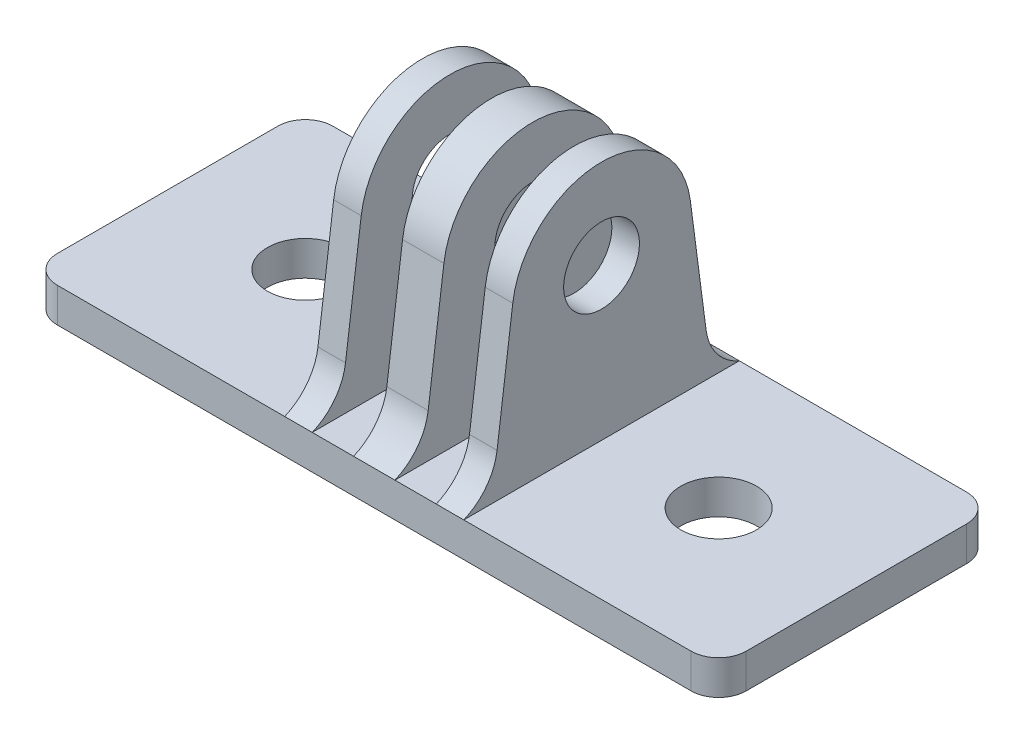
ISO-10303-21;
HEADER;
FILE_DESCRIPTION(('STEP AP214'),'2;1');
FILE_NAME('part.step','',(''),(''),'','','');
FILE_SCHEMA(('AUTOMOTIVE_DESIGN { 1 0 10303 214 1 1 1 1 }'));
ENDSEC;
DATA;
#1=APPLICATION_CONTEXT('core data for automotive mechanical design processes');
#2=APPLICATION_PROTOCOL_DEFINITION('international standard','automotive_design',2000,#1);
#3=PRODUCT_CONTEXT('',#1,'mechanical');
#4=PRODUCT('Part','Part','',(#3));
#5=PRODUCT_RELATED_PRODUCT_CATEGORY('part','',(#4));
#6=PRODUCT_DEFINITION_FORMATION('','',#4);
#7=PRODUCT_DEFINITION_CONTEXT('part definition',#1,'design');
#8=PRODUCT_DEFINITION('design','',#6,#7);
#9=PRODUCT_DEFINITION_SHAPE('','',#8);
#10=(LENGTH_UNIT() NAMED_UNIT(*) SI_UNIT(.MILLI.,.METRE.));
#11=(NAMED_UNIT(*) PLANE_ANGLE_UNIT() SI_UNIT($,.RADIAN.));
#12=(NAMED_UNIT(*) SI_UNIT($,.STERADIAN.) SOLID_ANGLE_UNIT());
#13=UNCERTAINTY_MEASURE_WITH_UNIT(LENGTH_MEASURE(1.E-05),#10,'distance_accuracy_value','');
#14=(GEOMETRIC_REPRESENTATION_CONTEXT(3) GLOBAL_UNCERTAINTY_ASSIGNED_CONTEXT((#13)) GLOBAL_UNIT_ASSIGNED_CONTEXT((#10,
#11,#12)) REPRESENTATION_CONTEXT('',''));
#15=CARTESIAN_POINT('',(0.,0.,0.));
#16=DIRECTION('',(0.,0.,1.));
#17=DIRECTION('',(1.,0.,0.));
#18=AXIS2_PLACEMENT_3D('',#15,#16,#17);
#19=CARTESIAN_POINT('',(50.,-11.,-8.));
#20=DIRECTION('',(0.,-0.130175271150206,0.991490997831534));
#21=DIRECTION('',(0.,-0.991490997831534,-0.130175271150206));
#22=AXIS2_PLACEMENT_3D('',#19,#20,#21);
#23=PLANE('',#22);
#24=DIRECTION('',(-1.,0.,0.));
#25=VECTOR('',#24,1.);
#26=CARTESIAN_POINT('',(50.,0.846139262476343,-6.44469148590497));
#27=LINE('',#26,#25);
#28=CARTESIAN_POINT('',(26.5,0.846139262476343,-6.44469148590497));
#29=VERTEX_POINT('',#28);
#30=CARTESIAN_POINT('',(23.5,0.846139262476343,-6.44469148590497));
#31=VERTEX_POINT('',#30);
#32=EDGE_CURVE('E489',#29,#31,#27,.T.);
#33=ORIENTED_EDGE('',*,*,#32,.F.);
#34=DIRECTION('',(0.,-0.991490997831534,-0.130175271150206));
#35=VECTOR('',#34,1.);
#36=CARTESIAN_POINT('',(26.5,-11.,-8.));
#37=LINE('',#36,#35);
#38=CARTESIAN_POINT('',(26.5,-7.83330681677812,-7.58423712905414));
#39=VERTEX_POINT('',#38);
#40=EDGE_CURVE('E397',#29,#39,#37,.T.);
#41=ORIENTED_EDGE('',*,*,#40,.T.);
#42=DIRECTION('',(-1.,0.,0.));
#43=VECTOR('',#42,1.);
#44=CARTESIAN_POINT('',(50.,-7.83330681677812,-7.58423712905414));
#45=LINE('',#44,#43);
#46=CARTESIAN_POINT('',(23.5,-7.83330681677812,-7.58423712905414));
#47=VERTEX_POINT('',#46);
#48=EDGE_CURVE('E458',#39,#47,#45,.T.);
#49=ORIENTED_EDGE('',*,*,#48,.T.);
#50=DIRECTION('',(0.,0.991490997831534,0.130175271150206));
#51=VECTOR('',#50,1.);
#52=CARTESIAN_POINT('',(23.5,-11.,-8.));
#53=LINE('',#52,#51);
#54=EDGE_CURVE('E418',#47,#31,#53,.T.);
#55=ORIENTED_EDGE('',*,*,#54,.T.);
#56=EDGE_LOOP('',(#33,#41,#49,#55));
#57=FACE_BOUND('',#56,.T.);
#58=ADVANCED_FACE('F31',(#57),#23,.F.);
#59=CARTESIAN_POINT('',(50.,0.,0.));
#60=DIRECTION('',(-1.,0.,0.));
#61=DIRECTION('',(0.,0.,1.));
#62=AXIS2_PLACEMENT_3D('',#59,#60,#61);
#63=CYLINDRICAL_SURFACE('',#62,6.5);
#64=DIRECTION('',(-1.,0.,0.));
#65=VECTOR('',#64,1.);
#66=CARTESIAN_POINT('',(50.,0.846139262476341,6.44469148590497));
#67=LINE('',#66,#65);
#68=CARTESIAN_POINT('',(26.5,0.846139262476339,6.44469148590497));
#69=VERTEX_POINT('',#68);
#70=CARTESIAN_POINT('',(23.5,0.846139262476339,6.44469148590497));
#71=VERTEX_POINT('',#70);
#72=EDGE_CURVE('E259',#69,#71,#67,.T.);
#73=ORIENTED_EDGE('',*,*,#72,.F.);
#74=CARTESIAN_POINT('',(26.5,0.,0.));
#75=DIRECTION('',(-1.,0.,0.));
#76=DIRECTION('',(0.,0.,1.));
#77=AXIS2_PLACEMENT_3D('',#74,#75,#76);
#78=CIRCLE('',#77,6.5);
#79=EDGE_CURVE('E394',#69,#29,#78,.T.);
#80=ORIENTED_EDGE('',*,*,#79,.T.);
#81=ORIENTED_EDGE('',*,*,#32,.T.);
#82=CARTESIAN_POINT('',(23.5,0.,0.));
#83=DIRECTION('',(1.,0.,0.));
#84=DIRECTION('',(0.,0.,-1.));
#85=AXIS2_PLACEMENT_3D('',#82,#83,#84);
#86=CIRCLE('',#85,6.5);
#87=EDGE_CURVE('E415',#31,#71,#86,.T.);
#88=ORIENTED_EDGE('',*,*,#87,.T.);
#89=EDGE_LOOP('',(#73,#80,#81,#88));
#90=FACE_BOUND('',#89,.T.);
#91=ADVANCED_FACE('F509',(#90),#63,.T.);
#92=CARTESIAN_POINT('',(50.,-11.,8.));
#93=DIRECTION('',(0.,-0.130175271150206,-0.991490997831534));
#94=DIRECTION('',(0.,0.991490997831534,-0.130175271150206));
#95=AXIS2_PLACEMENT_3D('',#92,#93,#94);
#96=PLANE('',#95);
#97=DIRECTION('',(1.,0.,0.));
#98=VECTOR('',#97,1.);
#99=CARTESIAN_POINT('',(50.,-7.83330681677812,7.58423712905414));
#100=LINE('',#99,#98);
#101=CARTESIAN_POINT('',(23.5,-7.83330681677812,7.58423712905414));
#102=VERTEX_POINT('',#101);
#103=CARTESIAN_POINT('',(26.5,-7.83330681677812,7.58423712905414));
#104=VERTEX_POINT('',#103);
#105=EDGE_CURVE('E465',#102,#104,#100,.T.);
#106=ORIENTED_EDGE('',*,*,#105,.T.);
#107=DIRECTION('',(0.,0.991490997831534,-0.130175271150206));
#108=VECTOR('',#107,1.);
#109=CARTESIAN_POINT('',(26.5,-11.,8.));
#110=LINE('',#109,#108);
#111=EDGE_CURVE('E391',#104,#69,#110,.T.);
#112=ORIENTED_EDGE('',*,*,#111,.T.);
#113=ORIENTED_EDGE('',*,*,#72,.T.);
#114=DIRECTION('',(0.,-0.991490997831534,0.130175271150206));
#115=VECTOR('',#114,1.);
#116=CARTESIAN_POINT('',(23.5,-11.,8.));
#117=LINE('',#116,#115);
#118=EDGE_CURVE('E411',#71,#102,#117,.T.);
#119=ORIENTED_EDGE('',*,*,#118,.T.);
#120=EDGE_LOOP('',(#106,#112,#113,#119));
#121=FACE_BOUND('',#120,.T.);
#122=ADVANCED_FACE('F482',(#121),#96,.F.);
#123=CARTESIAN_POINT('',(50.,-7.31260573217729,-11.5502011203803));
#124=DIRECTION('',(-1.,0.,0.));
#125=DIRECTION('',(0.,0.,1.));
#126=AXIS2_PLACEMENT_3D('',#123,#124,#125);
#127=CYLINDRICAL_SURFACE('',#126,4.);
#128=ORIENTED_EDGE('',*,*,#48,.F.);
#129=CARTESIAN_POINT('',(26.5,-7.31260573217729,-11.5502011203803));
#130=DIRECTION('',(-1.,0.,0.));
#131=DIRECTION('',(0.,0.,1.));
#132=AXIS2_PLACEMENT_3D('',#129,#130,#131);
#133=CIRCLE('',#132,4.);
#134=CARTESIAN_POINT('',(26.5,-11.,-10.));
#135=VERTEX_POINT('',#134);
#136=EDGE_CURVE('E400',#39,#135,#133,.F.);
#137=ORIENTED_EDGE('',*,*,#136,.T.);
#138=DIRECTION('',(-1.,0.,0.));
#139=VECTOR('',#138,1.);
#140=CARTESIAN_POINT('',(50.,-11.,-10.));
#141=LINE('',#140,#139);
#142=CARTESIAN_POINT('',(23.5,-11.,-10.));
#143=VERTEX_POINT('',#142);
#144=EDGE_CURVE('E492',#135,#143,#141,.T.);
#145=ORIENTED_EDGE('',*,*,#144,.T.);
#146=CARTESIAN_POINT('',(23.5,-7.31260573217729,-11.5502011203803));
#147=DIRECTION('',(1.,0.,0.));
#148=DIRECTION('',(0.,0.,-1.));
#149=AXIS2_PLACEMENT_3D('',#146,#147,#148);
#150=CIRCLE('',#149,4.);
#151=EDGE_CURVE('E421',#143,#47,#150,.F.);
#152=ORIENTED_EDGE('',*,*,#151,.T.);
#153=EDGE_LOOP('',(#128,#137,#145,#152));
#154=FACE_BOUND('',#153,.T.);
#155=ADVANCED_FACE('F496',(#154),#127,.F.);
#156=CARTESIAN_POINT('',(50.,-7.31260573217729,11.5502011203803));
#157=DIRECTION('',(1.,0.,0.));
#158=DIRECTION('',(0.,0.,-1.));
#159=AXIS2_PLACEMENT_3D('',#156,#157,#158);
#160=CYLINDRICAL_SURFACE('',#159,4.);
#161=DIRECTION('',(-1.,0.,0.));
#162=VECTOR('',#161,1.);
#163=CARTESIAN_POINT('',(50.,-11.,10.));
#164=LINE('',#163,#162);
#165=CARTESIAN_POINT('',(26.5,-11.,10.));
#166=VERTEX_POINT('',#165);
#167=CARTESIAN_POINT('',(23.5,-11.,10.));
#168=VERTEX_POINT('',#167);
#169=EDGE_CURVE('E246',#166,#168,#164,.T.);
#170=ORIENTED_EDGE('',*,*,#169,.F.);
#171=CARTESIAN_POINT('',(26.5,-7.31260573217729,11.5502011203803));
#172=DIRECTION('',(-1.,0.,0.));
#173=DIRECTION('',(0.,0.,1.));
#174=AXIS2_PLACEMENT_3D('',#171,#172,#173);
#175=CIRCLE('',#174,4.);
#176=EDGE_CURVE('E295',#166,#104,#175,.F.);
#177=ORIENTED_EDGE('',*,*,#176,.T.);
#178=ORIENTED_EDGE('',*,*,#105,.F.);
#179=CARTESIAN_POINT('',(23.5,-7.31260573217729,11.5502011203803));
#180=DIRECTION('',(1.,0.,0.));
#181=DIRECTION('',(0.,0.,-1.));
#182=AXIS2_PLACEMENT_3D('',#179,#180,#181);
#183=CIRCLE('',#182,4.);
#184=EDGE_CURVE('E300',#102,#168,#183,.F.);
#185=ORIENTED_EDGE('',*,*,#184,.T.);
#186=EDGE_LOOP('',(#170,#177,#178,#185));
#187=FACE_BOUND('',#186,.T.);
#188=ADVANCED_FACE('F474',(#187),#160,.F.);
#189=CARTESIAN_POINT('',(20.5,-7.83330681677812,-7.58423712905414));
#190=VERTEX_POINT('',#189);
#191=CARTESIAN_POINT('',(18.5,-7.83330681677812,-7.58423712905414));
#192=VERTEX_POINT('',#191);
#193=EDGE_CURVE('E455',#190,#192,#45,.T.);
#194=ORIENTED_EDGE('',*,*,#193,.T.);
#195=DIRECTION('',(0.,0.991490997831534,0.130175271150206));
#196=VECTOR('',#195,1.);
#197=CARTESIAN_POINT('',(18.5,-11.,-8.));
#198=LINE('',#197,#196);
#199=CARTESIAN_POINT('',(18.5,0.846139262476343,-6.44469148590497));
#200=VERTEX_POINT('',#199);
#201=EDGE_CURVE('E446',#192,#200,#198,.T.);
#202=ORIENTED_EDGE('',*,*,#201,.T.);
#203=CARTESIAN_POINT('',(20.5,0.846139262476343,-6.44469148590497));
#204=VERTEX_POINT('',#203);
#205=EDGE_CURVE('E485',#204,#200,#27,.T.);
#206=ORIENTED_EDGE('',*,*,#205,.F.);
#207=DIRECTION('',(0.,-0.991490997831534,-0.130175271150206));
#208=VECTOR('',#207,1.);
#209=CARTESIAN_POINT('',(20.5,-11.,-8.));
#210=LINE('',#209,#208);
#211=EDGE_CURVE('E430',#204,#190,#210,.T.);
#212=ORIENTED_EDGE('',*,*,#211,.T.);
#213=EDGE_LOOP('',(#194,#202,#206,#212));
#214=FACE_BOUND('',#213,.T.);
#215=ADVANCED_FACE('F457',(#214),#23,.F.);
#216=ORIENTED_EDGE('',*,*,#205,.T.);
#217=CARTESIAN_POINT('',(18.5,0.,0.));
#218=DIRECTION('',(1.,0.,0.));
#219=DIRECTION('',(0.,0.,-1.));
#220=AXIS2_PLACEMENT_3D('',#217,#218,#219);
#221=CIRCLE('',#220,6.5);
#222=CARTESIAN_POINT('',(18.5,0.846139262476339,6.44469148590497));
#223=VERTEX_POINT('',#222);
#224=EDGE_CURVE('E444',#200,#223,#221,.T.);
#225=ORIENTED_EDGE('',*,*,#224,.T.);
#226=CARTESIAN_POINT('',(20.5,0.846139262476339,6.44469148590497));
#227=VERTEX_POINT('',#226);
#228=EDGE_CURVE('E255',#227,#223,#67,.T.);
#229=ORIENTED_EDGE('',*,*,#228,.F.);
#230=CARTESIAN_POINT('',(20.5,0.,0.));
#231=DIRECTION('',(-1.,0.,0.));
#232=DIRECTION('',(0.,0.,1.));
#233=AXIS2_PLACEMENT_3D('',#230,#231,#232);
#234=CIRCLE('',#233,6.5);
#235=EDGE_CURVE('E427',#227,#204,#234,.T.);
#236=ORIENTED_EDGE('',*,*,#235,.T.);
#237=EDGE_LOOP('',(#216,#225,#229,#236));
#238=FACE_BOUND('',#237,.T.);
#239=ADVANCED_FACE('F507',(#238),#63,.T.);
#240=ORIENTED_EDGE('',*,*,#228,.T.);
#241=DIRECTION('',(0.,-0.991490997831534,0.130175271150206));
#242=VECTOR('',#241,1.);
#243=CARTESIAN_POINT('',(18.5,-11.,8.));
#244=LINE('',#243,#242);
#245=CARTESIAN_POINT('',(18.5,-7.83330681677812,7.58423712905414));
#246=VERTEX_POINT('',#245);
#247=EDGE_CURVE('E229',#223,#246,#244,.T.);
#248=ORIENTED_EDGE('',*,*,#247,.T.);
#249=CARTESIAN_POINT('',(20.5,-7.83330681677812,7.58423712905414));
#250=VERTEX_POINT('',#249);
#251=EDGE_CURVE('E239',#246,#250,#100,.T.);
#252=ORIENTED_EDGE('',*,*,#251,.T.);
#253=DIRECTION('',(0.,0.991490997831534,-0.130175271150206));
#254=VECTOR('',#253,1.);
#255=CARTESIAN_POINT('',(20.5,-11.,8.));
#256=LINE('',#255,#254);
#257=EDGE_CURVE('E424',#250,#227,#256,.T.);
#258=ORIENTED_EDGE('',*,*,#257,.T.);
#259=EDGE_LOOP('',(#240,#248,#252,#258));
#260=FACE_BOUND('',#259,.T.);
#261=ADVANCED_FACE('F505',(#260),#96,.F.);
#262=CARTESIAN_POINT('',(20.5,-11.,-10.));
#263=VERTEX_POINT('',#262);
#264=CARTESIAN_POINT('',(18.5,-11.,-10.));
#265=VERTEX_POINT('',#264);
#266=EDGE_CURVE('E456',#263,#265,#141,.T.);
#267=ORIENTED_EDGE('',*,*,#266,.T.);
#268=CARTESIAN_POINT('',(18.5,-7.31260573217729,-11.5502011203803));
#269=DIRECTION('',(1.,0.,0.));
#270=DIRECTION('',(0.,0.,-1.));
#271=AXIS2_PLACEMENT_3D('',#268,#269,#270);
#272=CIRCLE('',#271,4.);
#273=EDGE_CURVE('E228',#265,#192,#272,.F.);
#274=ORIENTED_EDGE('',*,*,#273,.T.);
#275=ORIENTED_EDGE('',*,*,#193,.F.);
#276=CARTESIAN_POINT('',(20.5,-7.31260573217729,-11.5502011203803));
#277=DIRECTION('',(-1.,0.,0.));
#278=DIRECTION('',(0.,0.,1.));
#279=AXIS2_PLACEMENT_3D('',#276,#277,#278);
#280=CIRCLE('',#279,4.);
#281=EDGE_CURVE('E433',#190,#263,#280,.F.);
#282=ORIENTED_EDGE('',*,*,#281,.T.);
#283=EDGE_LOOP('',(#267,#274,#275,#282));
#284=FACE_BOUND('',#283,.T.);
#285=ADVANCED_FACE('F454',(#284),#127,.F.);
#286=ORIENTED_EDGE('',*,*,#251,.F.);
#287=CARTESIAN_POINT('',(18.5,-7.31260573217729,11.5502011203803));
#288=DIRECTION('',(1.,0.,0.));
#289=DIRECTION('',(0.,0.,-1.));
#290=AXIS2_PLACEMENT_3D('',#287,#288,#289);
#291=CIRCLE('',#290,4.);
#292=CARTESIAN_POINT('',(18.5,-11.,10.));
#293=VERTEX_POINT('',#292);
#294=EDGE_CURVE('E225',#246,#293,#291,.F.);
#295=ORIENTED_EDGE('',*,*,#294,.T.);
#296=CARTESIAN_POINT('',(20.5,-11.,10.));
#297=VERTEX_POINT('',#296);
#298=EDGE_CURVE('E237',#297,#293,#164,.T.);
#299=ORIENTED_EDGE('',*,*,#298,.F.);
#300=CARTESIAN_POINT('',(20.5,-7.31260573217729,11.5502011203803));
#301=DIRECTION('',(-1.,0.,0.));
#302=DIRECTION('',(0.,0.,1.));
#303=AXIS2_PLACEMENT_3D('',#300,#301,#302);
#304=CIRCLE('',#303,4.);
#305=EDGE_CURVE('E296',#297,#250,#304,.F.);
#306=ORIENTED_EDGE('',*,*,#305,.T.);
#307=EDGE_LOOP('',(#286,#295,#299,#306));
#308=FACE_BOUND('',#307,.T.);
#309=ADVANCED_FACE('F235',(#308),#160,.F.);
#310=CARTESIAN_POINT('',(50.,-11.,10.));
#311=DIRECTION('',(0.,0.,-1.));
#312=DIRECTION('',(-1.,0.,0.));
#313=AXIS2_PLACEMENT_3D('',#310,#311,#312);
#314=PLANE('',#313);
#315=DIRECTION('',(-1.,0.,0.));
#316=VECTOR('',#315,1.);
#317=CARTESIAN_POINT('',(50.,-13.5,10.));
#318=LINE('',#317,#316);
#319=CARTESIAN_POINT('',(48.,-13.5,10.));
#320=VERTEX_POINT('',#319);
#321=CARTESIAN_POINT('',(2.,-13.5,10.));
#322=VERTEX_POINT('',#321);
#323=EDGE_CURVE('E351',#320,#322,#318,.T.);
#324=ORIENTED_EDGE('',*,*,#323,.F.);
#325=DIRECTION('',(0.,-1.,0.));
#326=VECTOR('',#325,1.);
#327=CARTESIAN_POINT('',(48.,-11.,10.));
#328=LINE('',#327,#326);
#329=CARTESIAN_POINT('',(48.,-11.,10.));
#330=VERTEX_POINT('',#329);
#331=EDGE_CURVE('E325',#320,#330,#328,.F.);
#332=ORIENTED_EDGE('',*,*,#331,.T.);
#333=CARTESIAN_POINT('',(31.5,-11.,10.));
#334=VERTEX_POINT('',#333);
#335=EDGE_CURVE('E249',#330,#334,#164,.T.);
#336=ORIENTED_EDGE('',*,*,#335,.T.);
#337=CARTESIAN_POINT('',(29.5,-11.,10.));
#338=VERTEX_POINT('',#337);
#339=EDGE_CURVE('E250',#334,#338,#164,.T.);
#340=ORIENTED_EDGE('',*,*,#339,.T.);
#341=DIRECTION('',(1.,0.,0.));
#342=VECTOR('',#341,1.);
#343=CARTESIAN_POINT('',(26.5,-11.,10.));
#344=LINE('',#343,#342);
#345=EDGE_CURVE('E265',#166,#338,#344,.T.);
#346=ORIENTED_EDGE('',*,*,#345,.F.);
#347=ORIENTED_EDGE('',*,*,#169,.T.);
#348=DIRECTION('',(1.,0.,0.));
#349=VECTOR('',#348,1.);
#350=CARTESIAN_POINT('',(20.5,-11.,10.));
#351=LINE('',#350,#349);
#352=EDGE_CURVE('E245',#297,#168,#351,.T.);
#353=ORIENTED_EDGE('',*,*,#352,.F.);
#354=ORIENTED_EDGE('',*,*,#298,.T.);
#355=DIRECTION('',(1.,0.,0.));
#356=VECTOR('',#355,1.);
#357=CARTESIAN_POINT('',(0.,-11.,10.));
#358=LINE('',#357,#356);
#359=CARTESIAN_POINT('',(2.,-11.,10.));
#360=VERTEX_POINT('',#359);
#361=EDGE_CURVE('E206',#360,#293,#358,.T.);
#362=ORIENTED_EDGE('',*,*,#361,.F.);
#363=DIRECTION('',(0.,-1.,0.));
#364=VECTOR('',#363,1.);
#365=CARTESIAN_POINT('',(2.,-11.,10.));
#366=LINE('',#365,#364);
#367=EDGE_CURVE('E323',#360,#322,#366,.T.);
#368=ORIENTED_EDGE('',*,*,#367,.T.);
#369=EDGE_LOOP('',(#324,#332,#336,#340,#346,#347,#353,#354,#362,#368));
#370=FACE_BOUND('',#369,.T.);
#371=ADVANCED_FACE('F33',(#370),#314,.F.);
#372=CARTESIAN_POINT('',(50.,-13.5,10.));
#373=DIRECTION('',(0.,1.,0.));
#374=DIRECTION('',(0.,0.,1.));
#375=AXIS2_PLACEMENT_3D('',#372,#373,#374);
#376=PLANE('',#375);
#377=CARTESIAN_POINT('',(10.,-13.5,0.));
#378=DIRECTION('',(0.,1.,0.));
#379=DIRECTION('',(0.,0.,1.));
#380=AXIS2_PLACEMENT_3D('',#377,#378,#379);
#381=CIRCLE('',#380,2.75);
#382=CARTESIAN_POINT('',(10.,-13.5,2.75));
#383=VERTEX_POINT('',#382);
#384=EDGE_CURVE('E557',#383,#383,#381,.T.);
#385=ORIENTED_EDGE('',*,*,#384,.T.);
#386=EDGE_LOOP('',(#385));
#387=FACE_BOUND('',#386,.T.);
#388=CARTESIAN_POINT('',(40.,-13.5,0.));
#389=DIRECTION('',(0.,1.,0.));
#390=DIRECTION('',(0.,0.,1.));
#391=AXIS2_PLACEMENT_3D('',#388,#389,#390);
#392=CIRCLE('',#391,2.75);
#393=CARTESIAN_POINT('',(40.,-13.5,2.75));
#394=VERTEX_POINT('',#393);
#395=EDGE_CURVE('E560',#394,#394,#392,.T.);
#396=ORIENTED_EDGE('',*,*,#395,.T.);
#397=EDGE_LOOP('',(#396));
#398=FACE_BOUND('',#397,.T.);
#399=DIRECTION('',(0.,0.,-1.));
#400=VECTOR('',#399,1.);
#401=CARTESIAN_POINT('',(50.,-13.5,10.));
#402=LINE('',#401,#400);
#403=CARTESIAN_POINT('',(50.,-13.5,8.));
#404=VERTEX_POINT('',#403);
#405=CARTESIAN_POINT('',(50.,-13.5,-8.));
#406=VERTEX_POINT('',#405);
#407=EDGE_CURVE('E247',#404,#406,#402,.T.);
#408=ORIENTED_EDGE('',*,*,#407,.F.);
#409=CARTESIAN_POINT('',(48.,-13.5,8.));
#410=DIRECTION('',(0.,1.,0.));
#411=DIRECTION('',(0.,0.,1.));
#412=AXIS2_PLACEMENT_3D('',#409,#410,#411);
#413=CIRCLE('',#412,2.);
#414=EDGE_CURVE('E321',#404,#320,#413,.F.);
#415=ORIENTED_EDGE('',*,*,#414,.T.);
#416=ORIENTED_EDGE('',*,*,#323,.T.);
#417=CARTESIAN_POINT('',(2.,-13.5,8.));
#418=DIRECTION('',(0.,1.,0.));
#419=DIRECTION('',(0.,0.,1.));
#420=AXIS2_PLACEMENT_3D('',#417,#418,#419);
#421=CIRCLE('',#420,2.);
#422=CARTESIAN_POINT('',(0.,-13.5,8.));
#423=VERTEX_POINT('',#422);
#424=EDGE_CURVE('E319',#322,#423,#421,.F.);
#425=ORIENTED_EDGE('',*,*,#424,.T.);
#426=DIRECTION('',(0.,0.,-1.));
#427=VECTOR('',#426,1.);
#428=CARTESIAN_POINT('',(0.,-13.5,10.));
#429=LINE('',#428,#427);
#430=CARTESIAN_POINT('',(0.,-13.5,-8.));
#431=VERTEX_POINT('',#430);
#432=EDGE_CURVE('E252',#423,#431,#429,.T.);
#433=ORIENTED_EDGE('',*,*,#432,.T.);
#434=CARTESIAN_POINT('',(2.,-13.5,-8.));
#435=DIRECTION('',(0.,1.,0.));
#436=DIRECTION('',(0.,0.,1.));
#437=AXIS2_PLACEMENT_3D('',#434,#435,#436);
#438=CIRCLE('',#437,2.);
#439=CARTESIAN_POINT('',(2.,-13.5,-10.));
#440=VERTEX_POINT('',#439);
#441=EDGE_CURVE('E317',#431,#440,#438,.F.);
#442=ORIENTED_EDGE('',*,*,#441,.T.);
#443=DIRECTION('',(-1.,0.,0.));
#444=VECTOR('',#443,1.);
#445=CARTESIAN_POINT('',(50.,-13.5,-10.));
#446=LINE('',#445,#444);
#447=CARTESIAN_POINT('',(48.,-13.5,-10.));
#448=VERTEX_POINT('',#447);
#449=EDGE_CURVE('E341',#448,#440,#446,.T.);
#450=ORIENTED_EDGE('',*,*,#449,.F.);
#451=CARTESIAN_POINT('',(48.,-13.5,-8.));
#452=DIRECTION('',(0.,1.,0.));
#453=DIRECTION('',(0.,0.,1.));
#454=AXIS2_PLACEMENT_3D('',#451,#452,#453);
#455=CIRCLE('',#454,2.);
#456=EDGE_CURVE('E315',#448,#406,#455,.F.);
#457=ORIENTED_EDGE('',*,*,#456,.T.);
#458=EDGE_LOOP('',(#408,#415,#416,#425,#433,#442,#450,#457));
#459=FACE_BOUND('',#458,.T.);
#460=ADVANCED_FACE('F348',(#387,#398,#459),#376,.F.);
#461=CARTESIAN_POINT('',(50.,-11.,-10.));
#462=DIRECTION('',(0.,0.,1.));
#463=DIRECTION('',(1.,0.,0.));
#464=AXIS2_PLACEMENT_3D('',#461,#462,#463);
#465=PLANE('',#464);
#466=ORIENTED_EDGE('',*,*,#449,.T.);
#467=DIRECTION('',(0.,1.,0.));
#468=VECTOR('',#467,1.);
#469=CARTESIAN_POINT('',(2.,-11.,-10.));
#470=LINE('',#469,#468);
#471=CARTESIAN_POINT('',(2.,-11.,-10.));
#472=VERTEX_POINT('',#471);
#473=EDGE_CURVE('E11',#440,#472,#470,.T.);
#474=ORIENTED_EDGE('',*,*,#473,.T.);
#475=DIRECTION('',(1.,0.,0.));
#476=VECTOR('',#475,1.);
#477=CARTESIAN_POINT('',(0.,-11.,-10.));
#478=LINE('',#477,#476);
#479=EDGE_CURVE('E218',#472,#265,#478,.T.);
#480=ORIENTED_EDGE('',*,*,#479,.T.);
#481=ORIENTED_EDGE('',*,*,#266,.F.);
#482=DIRECTION('',(1.,0.,0.));
#483=VECTOR('',#482,1.);
#484=CARTESIAN_POINT('',(20.5,-11.,-10.));
#485=LINE('',#484,#483);
#486=EDGE_CURVE('E404',#263,#143,#485,.T.);
#487=ORIENTED_EDGE('',*,*,#486,.T.);
#488=ORIENTED_EDGE('',*,*,#144,.F.);
#489=DIRECTION('',(1.,0.,0.));
#490=VECTOR('',#489,1.);
#491=CARTESIAN_POINT('',(26.5,-11.,-10.));
#492=LINE('',#491,#490);
#493=CARTESIAN_POINT('',(29.5,-11.,-10.));
#494=VERTEX_POINT('',#493);
#495=EDGE_CURVE('E288',#135,#494,#492,.T.);
#496=ORIENTED_EDGE('',*,*,#495,.T.);
#497=CARTESIAN_POINT('',(31.5,-11.,-10.));
#498=VERTEX_POINT('',#497);
#499=EDGE_CURVE('E490',#498,#494,#141,.T.);
#500=ORIENTED_EDGE('',*,*,#499,.F.);
#501=CARTESIAN_POINT('',(48.,-11.,-10.));
#502=VERTEX_POINT('',#501);
#503=EDGE_CURVE('E343',#502,#498,#141,.T.);
#504=ORIENTED_EDGE('',*,*,#503,.F.);
#505=DIRECTION('',(0.,1.,0.));
#506=VECTOR('',#505,1.);
#507=CARTESIAN_POINT('',(48.,-13.5,-10.));
#508=LINE('',#507,#506);
#509=EDGE_CURVE('E39',#502,#448,#508,.F.);
#510=ORIENTED_EDGE('',*,*,#509,.T.);
#511=EDGE_LOOP('',(#466,#474,#480,#481,#487,#488,#496,#500,#504,#510));
#512=FACE_BOUND('',#511,.T.);
#513=ADVANCED_FACE('F340',(#512),#465,.F.);
#514=CARTESIAN_POINT('',(31.5,0.846139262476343,-6.44469148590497));
#515=VERTEX_POINT('',#514);
#516=CARTESIAN_POINT('',(29.5,0.846139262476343,-6.44469148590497));
#517=VERTEX_POINT('',#516);
#518=EDGE_CURVE('E487',#515,#517,#27,.T.);
#519=ORIENTED_EDGE('',*,*,#518,.F.);
#520=DIRECTION('',(0.,-0.991490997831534,-0.130175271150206));
#521=VECTOR('',#520,1.);
#522=CARTESIAN_POINT('',(31.5,-11.,-8.));
#523=LINE('',#522,#521);
#524=CARTESIAN_POINT('',(31.5,-7.83330681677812,-7.58423712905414));
#525=VERTEX_POINT('',#524);
#526=EDGE_CURVE('E376',#515,#525,#523,.T.);
#527=ORIENTED_EDGE('',*,*,#526,.T.);
#528=CARTESIAN_POINT('',(29.5,-7.83330681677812,-7.58423712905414));
#529=VERTEX_POINT('',#528);
#530=EDGE_CURVE('E460',#525,#529,#45,.T.);
#531=ORIENTED_EDGE('',*,*,#530,.T.);
#532=DIRECTION('',(0.,0.991490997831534,0.130175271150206));
#533=VECTOR('',#532,1.);
#534=CARTESIAN_POINT('',(29.5,-11.,-8.));
#535=LINE('',#534,#533);
#536=EDGE_CURVE('E387',#529,#517,#535,.T.);
#537=ORIENTED_EDGE('',*,*,#536,.T.);
#538=EDGE_LOOP('',(#519,#527,#531,#537));
#539=FACE_BOUND('',#538,.T.);
#540=ADVANCED_FACE('F519',(#539),#23,.F.);
#541=CARTESIAN_POINT('',(31.5,0.846139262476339,6.44469148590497));
#542=VERTEX_POINT('',#541);
#543=CARTESIAN_POINT('',(29.5,0.846139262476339,6.44469148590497));
#544=VERTEX_POINT('',#543);
#545=EDGE_CURVE('E260',#542,#544,#67,.T.);
#546=ORIENTED_EDGE('',*,*,#545,.F.);
#547=CARTESIAN_POINT('',(31.5,0.,0.));
#548=DIRECTION('',(-1.,0.,0.));
#549=DIRECTION('',(0.,0.,1.));
#550=AXIS2_PLACEMENT_3D('',#547,#548,#549);
#551=CIRCLE('',#550,6.5);
#552=EDGE_CURVE('E368',#542,#515,#551,.T.);
#553=ORIENTED_EDGE('',*,*,#552,.T.);
#554=ORIENTED_EDGE('',*,*,#518,.T.);
#555=CARTESIAN_POINT('',(29.5,0.,0.));
#556=DIRECTION('',(1.,0.,0.));
#557=DIRECTION('',(0.,0.,-1.));
#558=AXIS2_PLACEMENT_3D('',#555,#556,#557);
#559=CIRCLE('',#558,6.5);
#560=EDGE_CURVE('E384',#517,#544,#559,.T.);
#561=ORIENTED_EDGE('',*,*,#560,.T.);
#562=EDGE_LOOP('',(#546,#553,#554,#561));
#563=FACE_BOUND('',#562,.T.);
#564=ADVANCED_FACE('F523',(#563),#63,.T.);
#565=CARTESIAN_POINT('',(29.5,-7.83330681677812,7.58423712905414));
#566=VERTEX_POINT('',#565);
#567=CARTESIAN_POINT('',(31.5,-7.83330681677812,7.58423712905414));
#568=VERTEX_POINT('',#567);
#569=EDGE_CURVE('E294',#566,#568,#100,.T.);
#570=ORIENTED_EDGE('',*,*,#569,.T.);
#571=DIRECTION('',(0.,0.991490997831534,-0.130175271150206));
#572=VECTOR('',#571,1.);
#573=CARTESIAN_POINT('',(31.5,-11.,8.));
#574=LINE('',#573,#572);
#575=EDGE_CURVE('E364',#568,#542,#574,.T.);
#576=ORIENTED_EDGE('',*,*,#575,.T.);
#577=ORIENTED_EDGE('',*,*,#545,.T.);
#578=DIRECTION('',(0.,-0.991490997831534,0.130175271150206));
#579=VECTOR('',#578,1.);
#580=CARTESIAN_POINT('',(29.5,-11.,8.));
#581=LINE('',#580,#579);
#582=EDGE_CURVE('E283',#544,#566,#581,.T.);
#583=ORIENTED_EDGE('',*,*,#582,.T.);
#584=EDGE_LOOP('',(#570,#576,#577,#583));
#585=FACE_BOUND('',#584,.T.);
#586=ADVANCED_FACE('F524',(#585),#96,.F.);
#587=CARTESIAN_POINT('',(50.,0.,0.));
#588=DIRECTION('',(1.,0.,0.));
#589=DIRECTION('',(0.,0.,-1.));
#590=AXIS2_PLACEMENT_3D('',#587,#588,#589);
#591=PLANE('',#590);
#592=DIRECTION('',(0.,0.,1.));
#593=VECTOR('',#592,1.);
#594=CARTESIAN_POINT('',(50.,-11.,-10.));
#595=LINE('',#594,#593);
#596=CARTESIAN_POINT('',(50.,-11.,-8.));
#597=VERTEX_POINT('',#596);
#598=CARTESIAN_POINT('',(50.,-11.,8.));
#599=VERTEX_POINT('',#598);
#600=EDGE_CURVE('E359',#597,#599,#595,.T.);
#601=ORIENTED_EDGE('',*,*,#600,.T.);
#602=DIRECTION('',(0.,-1.,0.));
#603=VECTOR('',#602,1.);
#604=CARTESIAN_POINT('',(50.,-13.5,8.));
#605=LINE('',#604,#603);
#606=EDGE_CURVE('E312',#599,#404,#605,.T.);
#607=ORIENTED_EDGE('',*,*,#606,.T.);
#608=ORIENTED_EDGE('',*,*,#407,.T.);
#609=DIRECTION('',(0.,1.,0.));
#610=VECTOR('',#609,1.);
#611=CARTESIAN_POINT('',(50.,-11.,-8.));
#612=LINE('',#611,#610);
#613=EDGE_CURVE('E240',#406,#597,#612,.T.);
#614=ORIENTED_EDGE('',*,*,#613,.T.);
#615=EDGE_LOOP('',(#601,#607,#608,#614));
#616=FACE_BOUND('',#615,.T.);
#617=ADVANCED_FACE('F358',(#616),#591,.T.);
#618=CARTESIAN_POINT('',(0.,0.,0.));
#619=DIRECTION('',(1.,0.,0.));
#620=DIRECTION('',(0.,0.,-1.));
#621=AXIS2_PLACEMENT_3D('',#618,#619,#620);
#622=PLANE('',#621);
#623=ORIENTED_EDGE('',*,*,#432,.F.);
#624=DIRECTION('',(0.,-1.,0.));
#625=VECTOR('',#624,1.);
#626=CARTESIAN_POINT('',(0.,0.,8.));
#627=LINE('',#626,#625);
#628=CARTESIAN_POINT('',(0.,-11.,8.));
#629=VERTEX_POINT('',#628);
#630=EDGE_CURVE('E53',#423,#629,#627,.F.);
#631=ORIENTED_EDGE('',*,*,#630,.T.);
#632=DIRECTION('',(0.,0.,1.));
#633=VECTOR('',#632,1.);
#634=CARTESIAN_POINT('',(0.,-11.,-10.));
#635=LINE('',#634,#633);
#636=CARTESIAN_POINT('',(0.,-11.,-8.));
#637=VERTEX_POINT('',#636);
#638=EDGE_CURVE('E230',#637,#629,#635,.T.);
#639=ORIENTED_EDGE('',*,*,#638,.F.);
#640=DIRECTION('',(0.,1.,0.));
#641=VECTOR('',#640,1.);
#642=CARTESIAN_POINT('',(0.,0.,-8.));
#643=LINE('',#642,#641);
#644=EDGE_CURVE('E331',#637,#431,#643,.F.);
#645=ORIENTED_EDGE('',*,*,#644,.T.);
#646=EDGE_LOOP('',(#623,#631,#639,#645));
#647=FACE_BOUND('',#646,.T.);
#648=ADVANCED_FACE('F531',(#647),#622,.F.);
#649=ORIENTED_EDGE('',*,*,#530,.F.);
#650=CARTESIAN_POINT('',(31.5,-7.31260573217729,-11.5502011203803));
#651=DIRECTION('',(-1.,0.,0.));
#652=DIRECTION('',(0.,0.,1.));
#653=AXIS2_PLACEMENT_3D('',#650,#651,#652);
#654=CIRCLE('',#653,4.);
#655=EDGE_CURVE('E289',#525,#498,#654,.F.);
#656=ORIENTED_EDGE('',*,*,#655,.T.);
#657=ORIENTED_EDGE('',*,*,#499,.T.);
#658=CARTESIAN_POINT('',(29.5,-7.31260573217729,-11.5502011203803));
#659=DIRECTION('',(1.,0.,0.));
#660=DIRECTION('',(0.,0.,-1.));
#661=AXIS2_PLACEMENT_3D('',#658,#659,#660);
#662=CIRCLE('',#661,4.);
#663=EDGE_CURVE('E279',#494,#529,#662,.F.);
#664=ORIENTED_EDGE('',*,*,#663,.T.);
#665=EDGE_LOOP('',(#649,#656,#657,#664));
#666=FACE_BOUND('',#665,.T.);
#667=ADVANCED_FACE('F514',(#666),#127,.F.);
#668=ORIENTED_EDGE('',*,*,#339,.F.);
#669=CARTESIAN_POINT('',(31.5,-7.31260573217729,11.5502011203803));
#670=DIRECTION('',(-1.,0.,0.));
#671=DIRECTION('',(0.,0.,1.));
#672=AXIS2_PLACEMENT_3D('',#669,#670,#671);
#673=CIRCLE('',#672,4.);
#674=EDGE_CURVE('E241',#334,#568,#673,.F.);
#675=ORIENTED_EDGE('',*,*,#674,.T.);
#676=ORIENTED_EDGE('',*,*,#569,.F.);
#677=CARTESIAN_POINT('',(29.5,-7.31260573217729,11.5502011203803));
#678=DIRECTION('',(1.,0.,0.));
#679=DIRECTION('',(0.,0.,-1.));
#680=AXIS2_PLACEMENT_3D('',#677,#678,#679);
#681=CIRCLE('',#680,4.);
#682=EDGE_CURVE('E275',#566,#338,#681,.F.);
#683=ORIENTED_EDGE('',*,*,#682,.T.);
#684=EDGE_LOOP('',(#668,#675,#676,#683));
#685=FACE_BOUND('',#684,.T.);
#686=ADVANCED_FACE('F292',(#685),#160,.F.);
#687=CARTESIAN_POINT('',(20.5,-11.,-10.));
#688=DIRECTION('',(-1.,0.,0.));
#689=DIRECTION('',(0.,0.,1.));
#690=AXIS2_PLACEMENT_3D('',#687,#688,#689);
#691=PLANE('',#690);
#692=CARTESIAN_POINT('',(20.5,0.,0.));
#693=DIRECTION('',(-1.,0.,0.));
#694=DIRECTION('',(0.,0.,1.));
#695=AXIS2_PLACEMENT_3D('',#692,#693,#694);
#696=CIRCLE('',#695,2.75);
#697=CARTESIAN_POINT('',(20.5,0.,2.75));
#698=VERTEX_POINT('',#697);
#699=EDGE_CURVE('E219',#698,#698,#696,.T.);
#700=ORIENTED_EDGE('',*,*,#699,.T.);
#701=EDGE_LOOP('',(#700));
#702=FACE_BOUND('',#701,.T.);
#703=ORIENTED_EDGE('',*,*,#211,.F.);
#704=ORIENTED_EDGE('',*,*,#235,.F.);
#705=ORIENTED_EDGE('',*,*,#257,.F.);
#706=ORIENTED_EDGE('',*,*,#305,.F.);
#707=DIRECTION('',(0.,0.,1.));
#708=VECTOR('',#707,1.);
#709=CARTESIAN_POINT('',(20.5,-11.,-10.));
#710=LINE('',#709,#708);
#711=EDGE_CURVE('E407',#263,#297,#710,.T.);
#712=ORIENTED_EDGE('',*,*,#711,.F.);
#713=ORIENTED_EDGE('',*,*,#281,.F.);
#714=EDGE_LOOP('',(#703,#704,#705,#706,#712,#713));
#715=FACE_BOUND('',#714,.T.);
#716=ADVANCED_FACE('F503',(#702,#715),#691,.F.);
#717=CARTESIAN_POINT('',(23.5,-11.,-10.));
#718=DIRECTION('',(1.,0.,0.));
#719=DIRECTION('',(0.,0.,-1.));
#720=AXIS2_PLACEMENT_3D('',#717,#718,#719);
#721=PLANE('',#720);
#722=CARTESIAN_POINT('',(23.5,0.,0.));
#723=DIRECTION('',(1.,0.,0.));
#724=DIRECTION('',(0.,0.,-1.));
#725=AXIS2_PLACEMENT_3D('',#722,#723,#724);
#726=CIRCLE('',#725,2.75);
#727=CARTESIAN_POINT('',(23.5,0.,-2.75));
#728=VERTEX_POINT('',#727);
#729=EDGE_CURVE('E575',#728,#728,#726,.T.);
#730=ORIENTED_EDGE('',*,*,#729,.T.);
#731=EDGE_LOOP('',(#730));
#732=FACE_BOUND('',#731,.T.);
#733=DIRECTION('',(0.,0.,1.));
#734=VECTOR('',#733,1.);
#735=CARTESIAN_POINT('',(23.5,-11.,-10.));
#736=LINE('',#735,#734);
#737=EDGE_CURVE('E408',#143,#168,#736,.T.);
#738=ORIENTED_EDGE('',*,*,#737,.T.);
#739=ORIENTED_EDGE('',*,*,#184,.F.);
#740=ORIENTED_EDGE('',*,*,#118,.F.);
#741=ORIENTED_EDGE('',*,*,#87,.F.);
#742=ORIENTED_EDGE('',*,*,#54,.F.);
#743=ORIENTED_EDGE('',*,*,#151,.F.);
#744=EDGE_LOOP('',(#738,#739,#740,#741,#742,#743));
#745=FACE_BOUND('',#744,.T.);
#746=ADVANCED_FACE('F477',(#732,#745),#721,.F.);
#747=CARTESIAN_POINT('',(20.5,-11.,-10.));
#748=DIRECTION('',(0.,-1.,0.));
#749=DIRECTION('',(0.,0.,-1.));
#750=AXIS2_PLACEMENT_3D('',#747,#748,#749);
#751=PLANE('',#750);
#752=ORIENTED_EDGE('',*,*,#352,.T.);
#753=ORIENTED_EDGE('',*,*,#737,.F.);
#754=ORIENTED_EDGE('',*,*,#486,.F.);
#755=ORIENTED_EDGE('',*,*,#711,.T.);
#756=EDGE_LOOP('',(#752,#753,#754,#755));
#757=FACE_BOUND('',#756,.T.);
#758=ADVANCED_FACE('F500',(#757),#751,.F.);
#759=CARTESIAN_POINT('',(26.5,-11.,-10.));
#760=DIRECTION('',(-1.,0.,0.));
#761=DIRECTION('',(0.,0.,1.));
#762=AXIS2_PLACEMENT_3D('',#759,#760,#761);
#763=PLANE('',#762);
#764=CARTESIAN_POINT('',(26.5,0.,0.));
#765=DIRECTION('',(-1.,0.,0.));
#766=DIRECTION('',(0.,0.,1.));
#767=AXIS2_PLACEMENT_3D('',#764,#765,#766);
#768=CIRCLE('',#767,2.75);
#769=CARTESIAN_POINT('',(26.5,0.,2.75));
#770=VERTEX_POINT('',#769);
#771=EDGE_CURVE('E572',#770,#770,#768,.T.);
#772=ORIENTED_EDGE('',*,*,#771,.T.);
#773=EDGE_LOOP('',(#772));
#774=FACE_BOUND('',#773,.T.);
#775=ORIENTED_EDGE('',*,*,#40,.F.);
#776=ORIENTED_EDGE('',*,*,#79,.F.);
#777=ORIENTED_EDGE('',*,*,#111,.F.);
#778=ORIENTED_EDGE('',*,*,#176,.F.);
#779=DIRECTION('',(0.,0.,1.));
#780=VECTOR('',#779,1.);
#781=CARTESIAN_POINT('',(26.5,-11.,-10.));
#782=LINE('',#781,#780);
#783=EDGE_CURVE('E284',#135,#166,#782,.T.);
#784=ORIENTED_EDGE('',*,*,#783,.F.);
#785=ORIENTED_EDGE('',*,*,#136,.F.);
#786=EDGE_LOOP('',(#775,#776,#777,#778,#784,#785));
#787=FACE_BOUND('',#786,.T.);
#788=ADVANCED_FACE('F512',(#774,#787),#763,.F.);
#789=CARTESIAN_POINT('',(29.5,-11.,-10.));
#790=DIRECTION('',(1.,0.,0.));
#791=DIRECTION('',(0.,0.,-1.));
#792=AXIS2_PLACEMENT_3D('',#789,#790,#791);
#793=PLANE('',#792);
#794=CARTESIAN_POINT('',(29.5,0.,0.));
#795=DIRECTION('',(1.,0.,0.));
#796=DIRECTION('',(0.,0.,-1.));
#797=AXIS2_PLACEMENT_3D('',#794,#795,#796);
#798=CIRCLE('',#797,2.75);
#799=CARTESIAN_POINT('',(29.5,0.,-2.75));
#800=VERTEX_POINT('',#799);
#801=EDGE_CURVE('E308',#800,#800,#798,.T.);
#802=ORIENTED_EDGE('',*,*,#801,.T.);
#803=EDGE_LOOP('',(#802));
#804=FACE_BOUND('',#803,.T.);
#805=DIRECTION('',(0.,0.,1.));
#806=VECTOR('',#805,1.);
#807=CARTESIAN_POINT('',(29.5,-11.,-10.));
#808=LINE('',#807,#806);
#809=EDGE_CURVE('E272',#494,#338,#808,.T.);
#810=ORIENTED_EDGE('',*,*,#809,.T.);
#811=ORIENTED_EDGE('',*,*,#682,.F.);
#812=ORIENTED_EDGE('',*,*,#582,.F.);
#813=ORIENTED_EDGE('',*,*,#560,.F.);
#814=ORIENTED_EDGE('',*,*,#536,.F.);
#815=ORIENTED_EDGE('',*,*,#663,.F.);
#816=EDGE_LOOP('',(#810,#811,#812,#813,#814,#815));
#817=FACE_BOUND('',#816,.T.);
#818=ADVANCED_FACE('F273',(#804,#817),#793,.F.);
#819=CARTESIAN_POINT('',(26.5,-11.,-10.));
#820=DIRECTION('',(0.,-1.,0.));
#821=DIRECTION('',(0.,0.,-1.));
#822=AXIS2_PLACEMENT_3D('',#819,#820,#821);
#823=PLANE('',#822);
#824=ORIENTED_EDGE('',*,*,#345,.T.);
#825=ORIENTED_EDGE('',*,*,#809,.F.);
#826=ORIENTED_EDGE('',*,*,#495,.F.);
#827=ORIENTED_EDGE('',*,*,#783,.T.);
#828=EDGE_LOOP('',(#824,#825,#826,#827));
#829=FACE_BOUND('',#828,.T.);
#830=ADVANCED_FACE('F286',(#829),#823,.F.);
#831=CARTESIAN_POINT('',(31.5,-11.,-10.));
#832=DIRECTION('',(-1.,0.,0.));
#833=DIRECTION('',(0.,0.,1.));
#834=AXIS2_PLACEMENT_3D('',#831,#832,#833);
#835=PLANE('',#834);
#836=CARTESIAN_POINT('',(31.5,0.,0.));
#837=DIRECTION('',(1.,0.,0.));
#838=DIRECTION('',(0.,0.,-1.));
#839=AXIS2_PLACEMENT_3D('',#836,#837,#838);
#840=CIRCLE('',#839,2.75);
#841=CARTESIAN_POINT('',(31.5,0.,-2.75));
#842=VERTEX_POINT('',#841);
#843=EDGE_CURVE('E309',#842,#842,#840,.T.);
#844=ORIENTED_EDGE('',*,*,#843,.F.);
#845=EDGE_LOOP('',(#844));
#846=FACE_BOUND('',#845,.T.);
#847=ORIENTED_EDGE('',*,*,#526,.F.);
#848=ORIENTED_EDGE('',*,*,#552,.F.);
#849=ORIENTED_EDGE('',*,*,#575,.F.);
#850=ORIENTED_EDGE('',*,*,#674,.F.);
#851=DIRECTION('',(0.,0.,1.));
#852=VECTOR('',#851,1.);
#853=CARTESIAN_POINT('',(31.5,-11.,-10.));
#854=LINE('',#853,#852);
#855=EDGE_CURVE('E365',#498,#334,#854,.T.);
#856=ORIENTED_EDGE('',*,*,#855,.F.);
#857=ORIENTED_EDGE('',*,*,#655,.F.);
#858=EDGE_LOOP('',(#847,#848,#849,#850,#856,#857));
#859=FACE_BOUND('',#858,.T.);
#860=ADVANCED_FACE('F516',(#846,#859),#835,.F.);
#861=CARTESIAN_POINT('',(50.,-11.,-10.));
#862=DIRECTION('',(0.,-1.,0.));
#863=DIRECTION('',(1.,0.,0.));
#864=AXIS2_PLACEMENT_3D('',#861,#862,#863);
#865=PLANE('',#864);
#866=CARTESIAN_POINT('',(40.,-11.,0.));
#867=DIRECTION('',(0.,1.,0.));
#868=DIRECTION('',(0.,0.,1.));
#869=AXIS2_PLACEMENT_3D('',#866,#867,#868);
#870=CIRCLE('',#869,2.75);
#871=CARTESIAN_POINT('',(40.,-11.,2.75));
#872=VERTEX_POINT('',#871);
#873=EDGE_CURVE('E562',#872,#872,#870,.T.);
#874=ORIENTED_EDGE('',*,*,#873,.F.);
#875=EDGE_LOOP('',(#874));
#876=FACE_BOUND('',#875,.T.);
#877=ORIENTED_EDGE('',*,*,#335,.F.);
#878=CARTESIAN_POINT('',(48.,-11.,8.));
#879=DIRECTION('',(0.,-1.,0.));
#880=DIRECTION('',(1.,0.,0.));
#881=AXIS2_PLACEMENT_3D('',#878,#879,#880);
#882=CIRCLE('',#881,2.);
#883=EDGE_CURVE('E329',#330,#599,#882,.F.);
#884=ORIENTED_EDGE('',*,*,#883,.T.);
#885=ORIENTED_EDGE('',*,*,#600,.F.);
#886=CARTESIAN_POINT('',(48.,-11.,-8.));
#887=DIRECTION('',(0.,-1.,0.));
#888=DIRECTION('',(1.,0.,0.));
#889=AXIS2_PLACEMENT_3D('',#886,#887,#888);
#890=CIRCLE('',#889,2.);
#891=EDGE_CURVE('E327',#597,#502,#890,.F.);
#892=ORIENTED_EDGE('',*,*,#891,.T.);
#893=ORIENTED_EDGE('',*,*,#503,.T.);
#894=ORIENTED_EDGE('',*,*,#855,.T.);
#895=EDGE_LOOP('',(#877,#884,#885,#892,#893,#894));
#896=FACE_BOUND('',#895,.T.);
#897=ADVANCED_FACE('F362',(#876,#896),#865,.F.);
#898=CARTESIAN_POINT('',(18.5,-11.,-10.));
#899=DIRECTION('',(1.,0.,0.));
#900=DIRECTION('',(0.,0.,-1.));
#901=AXIS2_PLACEMENT_3D('',#898,#899,#900);
#902=PLANE('',#901);
#903=CARTESIAN_POINT('',(18.5,0.,0.));
#904=DIRECTION('',(1.,0.,0.));
#905=DIRECTION('',(0.,0.,-1.));
#906=AXIS2_PLACEMENT_3D('',#903,#904,#905);
#907=CIRCLE('',#906,2.75);
#908=CARTESIAN_POINT('',(18.5,0.,-2.75));
#909=VERTEX_POINT('',#908);
#910=EDGE_CURVE('E305',#909,#909,#907,.T.);
#911=ORIENTED_EDGE('',*,*,#910,.T.);
#912=EDGE_LOOP('',(#911));
#913=FACE_BOUND('',#912,.T.);
#914=DIRECTION('',(0.,0.,1.));
#915=VECTOR('',#914,1.);
#916=CARTESIAN_POINT('',(18.5,-11.,-10.));
#917=LINE('',#916,#915);
#918=EDGE_CURVE('E210',#265,#293,#917,.T.);
#919=ORIENTED_EDGE('',*,*,#918,.T.);
#920=ORIENTED_EDGE('',*,*,#294,.F.);
#921=ORIENTED_EDGE('',*,*,#247,.F.);
#922=ORIENTED_EDGE('',*,*,#224,.F.);
#923=ORIENTED_EDGE('',*,*,#201,.F.);
#924=ORIENTED_EDGE('',*,*,#273,.F.);
#925=EDGE_LOOP('',(#919,#920,#921,#922,#923,#924));
#926=FACE_BOUND('',#925,.T.);
#927=ADVANCED_FACE('F224',(#913,#926),#902,.F.);
#928=CARTESIAN_POINT('',(0.,-11.,-10.));
#929=DIRECTION('',(0.,-1.,0.));
#930=DIRECTION('',(0.,0.,-1.));
#931=AXIS2_PLACEMENT_3D('',#928,#929,#930);
#932=PLANE('',#931);
#933=CARTESIAN_POINT('',(10.,-11.,0.));
#934=DIRECTION('',(0.,1.,0.));
#935=DIRECTION('',(0.,0.,1.));
#936=AXIS2_PLACEMENT_3D('',#933,#934,#935);
#937=CIRCLE('',#936,2.75);
#938=CARTESIAN_POINT('',(10.,-11.,2.75));
#939=VERTEX_POINT('',#938);
#940=EDGE_CURVE('E876',#939,#939,#937,.T.);
#941=ORIENTED_EDGE('',*,*,#940,.F.);
#942=EDGE_LOOP('',(#941));
#943=FACE_BOUND('',#942,.T.);
#944=ORIENTED_EDGE('',*,*,#638,.T.);
#945=CARTESIAN_POINT('',(2.,-11.,8.));
#946=DIRECTION('',(0.,-1.,0.));
#947=DIRECTION('',(0.,0.,-1.));
#948=AXIS2_PLACEMENT_3D('',#945,#946,#947);
#949=CIRCLE('',#948,2.);
#950=EDGE_CURVE('E213',#629,#360,#949,.F.);
#951=ORIENTED_EDGE('',*,*,#950,.T.);
#952=ORIENTED_EDGE('',*,*,#361,.T.);
#953=ORIENTED_EDGE('',*,*,#918,.F.);
#954=ORIENTED_EDGE('',*,*,#479,.F.);
#955=CARTESIAN_POINT('',(2.,-11.,-8.));
#956=DIRECTION('',(0.,-1.,0.));
#957=DIRECTION('',(0.,0.,-1.));
#958=AXIS2_PLACEMENT_3D('',#955,#956,#957);
#959=CIRCLE('',#958,2.);
#960=EDGE_CURVE('E46',#472,#637,#959,.F.);
#961=ORIENTED_EDGE('',*,*,#960,.T.);
#962=EDGE_LOOP('',(#944,#951,#952,#953,#954,#961));
#963=FACE_BOUND('',#962,.T.);
#964=ADVANCED_FACE('F208',(#943,#963),#932,.F.);
#965=CARTESIAN_POINT('',(-18.5,0.,0.));
#966=DIRECTION('',(1.,0.,0.));
#967=DIRECTION('',(0.,0.,-1.));
#968=AXIS2_PLACEMENT_3D('',#965,#966,#967);
#969=CYLINDRICAL_SURFACE('',#968,2.75);
#970=ORIENTED_EDGE('',*,*,#910,.F.);
#971=EDGE_LOOP('',(#970));
#972=FACE_BOUND('',#971,.T.);
#973=ORIENTED_EDGE('',*,*,#699,.F.);
#974=EDGE_LOOP('',(#973));
#975=FACE_BOUND('',#974,.T.);
#976=ADVANCED_FACE('F581',(#972,#975),#969,.F.);
#977=ORIENTED_EDGE('',*,*,#843,.T.);
#978=EDGE_LOOP('',(#977));
#979=FACE_BOUND('',#978,.T.);
#980=ORIENTED_EDGE('',*,*,#801,.F.);
#981=EDGE_LOOP('',(#980));
#982=FACE_BOUND('',#981,.T.);
#983=ADVANCED_FACE('F583',(#979,#982),#969,.F.);
#984=ORIENTED_EDGE('',*,*,#771,.F.);
#985=EDGE_LOOP('',(#984));
#986=FACE_BOUND('',#985,.T.);
#987=ORIENTED_EDGE('',*,*,#729,.F.);
#988=EDGE_LOOP('',(#987));
#989=FACE_BOUND('',#988,.T.);
#990=ADVANCED_FACE('F586',(#986,#989),#969,.F.);
#991=CARTESIAN_POINT('',(40.,-61.,0.));
#992=DIRECTION('',(0.,1.,0.));
#993=DIRECTION('',(0.,0.,1.));
#994=AXIS2_PLACEMENT_3D('',#991,#992,#993);
#995=CYLINDRICAL_SURFACE('',#994,2.75);
#996=ORIENTED_EDGE('',*,*,#873,.T.);
#997=EDGE_LOOP('',(#996));
#998=FACE_BOUND('',#997,.T.);
#999=ORIENTED_EDGE('',*,*,#395,.F.);
#1000=EDGE_LOOP('',(#999));
#1001=FACE_BOUND('',#1000,.T.);
#1002=ADVANCED_FACE('F598',(#998,#1001),#995,.F.);
#1003=CARTESIAN_POINT('',(10.,-61.,0.));
#1004=DIRECTION('',(0.,1.,0.));
#1005=DIRECTION('',(0.,0.,1.));
#1006=AXIS2_PLACEMENT_3D('',#1003,#1004,#1005);
#1007=CYLINDRICAL_SURFACE('',#1006,2.75);
#1008=ORIENTED_EDGE('',*,*,#940,.T.);
#1009=EDGE_LOOP('',(#1008));
#1010=FACE_BOUND('',#1009,.T.);
#1011=ORIENTED_EDGE('',*,*,#384,.F.);
#1012=EDGE_LOOP('',(#1011));
#1013=FACE_BOUND('',#1012,.T.);
#1014=ADVANCED_FACE('F603',(#1010,#1013),#1007,.F.);
#1015=CARTESIAN_POINT('',(48.,0.,8.));
#1016=DIRECTION('',(0.,1.,0.));
#1017=DIRECTION('',(0.,0.,1.));
#1018=AXIS2_PLACEMENT_3D('',#1015,#1016,#1017);
#1019=CYLINDRICAL_SURFACE('',#1018,2.);
#1020=ORIENTED_EDGE('',*,*,#883,.F.);
#1021=ORIENTED_EDGE('',*,*,#331,.F.);
#1022=ORIENTED_EDGE('',*,*,#414,.F.);
#1023=ORIENTED_EDGE('',*,*,#606,.F.);
#1024=EDGE_LOOP('',(#1020,#1021,#1022,#1023));
#1025=FACE_BOUND('',#1024,.T.);
#1026=ADVANCED_FACE('F719',(#1025),#1019,.T.);
#1027=CARTESIAN_POINT('',(2.,-11.,8.));
#1028=DIRECTION('',(0.,-1.,0.));
#1029=DIRECTION('',(0.,0.,-1.));
#1030=AXIS2_PLACEMENT_3D('',#1027,#1028,#1029);
#1031=CYLINDRICAL_SURFACE('',#1030,2.);
#1032=ORIENTED_EDGE('',*,*,#950,.F.);
#1033=ORIENTED_EDGE('',*,*,#630,.F.);
#1034=ORIENTED_EDGE('',*,*,#424,.F.);
#1035=ORIENTED_EDGE('',*,*,#367,.F.);
#1036=EDGE_LOOP('',(#1032,#1033,#1034,#1035));
#1037=FACE_BOUND('',#1036,.T.);
#1038=ADVANCED_FACE('F829',(#1037),#1031,.T.);
#1039=CARTESIAN_POINT('',(2.,-11.,-8.));
#1040=DIRECTION('',(0.,1.,0.));
#1041=DIRECTION('',(0.,0.,1.));
#1042=AXIS2_PLACEMENT_3D('',#1039,#1040,#1041);
#1043=CYLINDRICAL_SURFACE('',#1042,2.);
#1044=ORIENTED_EDGE('',*,*,#441,.F.);
#1045=ORIENTED_EDGE('',*,*,#644,.F.);
#1046=ORIENTED_EDGE('',*,*,#960,.F.);
#1047=ORIENTED_EDGE('',*,*,#473,.F.);
#1048=EDGE_LOOP('',(#1044,#1045,#1046,#1047));
#1049=FACE_BOUND('',#1048,.T.);
#1050=ADVANCED_FACE('F437',(#1049),#1043,.T.);
#1051=CARTESIAN_POINT('',(48.,0.,-8.));
#1052=DIRECTION('',(0.,-1.,0.));
#1053=DIRECTION('',(0.,0.,-1.));
#1054=AXIS2_PLACEMENT_3D('',#1051,#1052,#1053);
#1055=CYLINDRICAL_SURFACE('',#1054,2.);
#1056=ORIENTED_EDGE('',*,*,#456,.F.);
#1057=ORIENTED_EDGE('',*,*,#509,.F.);
#1058=ORIENTED_EDGE('',*,*,#891,.F.);
#1059=ORIENTED_EDGE('',*,*,#613,.F.);
#1060=EDGE_LOOP('',(#1056,#1057,#1058,#1059));
#1061=FACE_BOUND('',#1060,.T.);
#1062=ADVANCED_FACE('F354',(#1061),#1055,.T.);
#1063=CLOSED_SHELL('',(#58,#91,#122,#155,#188,#215,#239,#261,#285,#309,#371,#460,#513,#540,#564,
#586,#617,#648,#667,#686,#716,#746,#758,#788,#818,#830,#860,#897,#927,#964,#976,#983,#990,#1002,
#1014,#1026,#1038,#1050,#1062));
#1064=MANIFOLD_SOLID_BREP('B2',#1063);
#1065=ADVANCED_BREP_SHAPE_REPRESENTATION('',(#18,#1064),#14);
#1066=SHAPE_DEFINITION_REPRESENTATION(#9,#1065);
ENDSEC;
END-ISO-10303-21;
